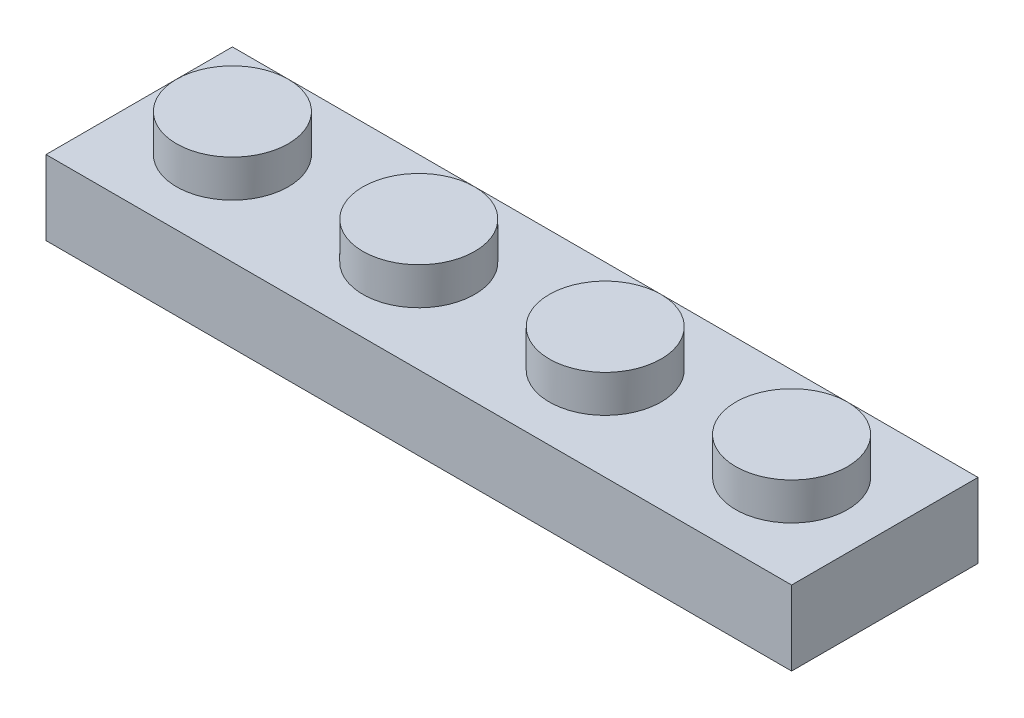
from build123d import *

# Parameters (mm, degrees)
SKETCH1_W            = 32
SKETCH1_H            = 8
BOSS_EXTRUDE1_DEPTH  = 3.2
SKETCH2_R            = 2.4
BOSS_EXTRUDE2_DEPTH  = 1.6
SHELL1_T             = -1.6
SKETCH11_R           = 1.77
BOSS_EXTRUDE11_DEPTH = 1.6
LPATTERN4_COUNT      = 3
LPATTERN4_PITCH      = 8


with BuildPart() as part:
    # Sketch1 → Boss-Extrude1 (new body)
    with BuildSketch(Plane(origin=(0, 0, 0), x_dir=(1, 0, 0), z_dir=(0, 1, 0))):
        Rectangle(SKETCH1_W, SKETCH1_H)
    extrude(amount=BOSS_EXTRUDE1_DEPTH)

    # Sketch2 → Boss-Extrude2 (add)
    with BuildSketch(Plane(origin=(0, 3.2, 0), x_dir=(1, 0, 0), z_dir=(0, 1, 0))):
        with Locations(Location((-12, 0, 0), (0, 0, 90))):
            Circle(SKETCH2_R)
        with Locations(Location((-4, 0, 0), (0, 0, 90))):
            Circle(SKETCH2_R)
        with Locations(Location((4, 0, 0), (0, 0, 90))):
            Circle(SKETCH2_R)
        with Locations(Location((12, 0, 0), (0, 0, 90))):
            Circle(SKETCH2_R)
    extrude(amount=BOSS_EXTRUDE2_DEPTH)

    # Shell1
    shell1_openings = [part.faces().sort_by_distance(p)[0] for p in [
        (0, 0, 0),
    ]]
    offset(amount=SHELL1_T, openings=shell1_openings, kind=Kind.INTERSECTION)

    # Sketch11 → Boss-Extrude11 (add)
    with BuildSketch(Plane(origin=(0, 1.6, 0), x_dir=(-1, 0, 0), z_dir=(0, -1, 0))):
        with Locations(Location((8, 0, 0), (0, 0, 270))):
            Circle(SKETCH11_R)
    boss_extrude11 = extrude(amount=BOSS_EXTRUDE11_DEPTH)

    # LPattern4: Boss-Extrude11 ×3
    with Locations(*[(i * LPATTERN4_PITCH, 0, 0) for i in range(1, LPATTERN4_COUNT)]):
        add(boss_extrude11)


solid = part.part
